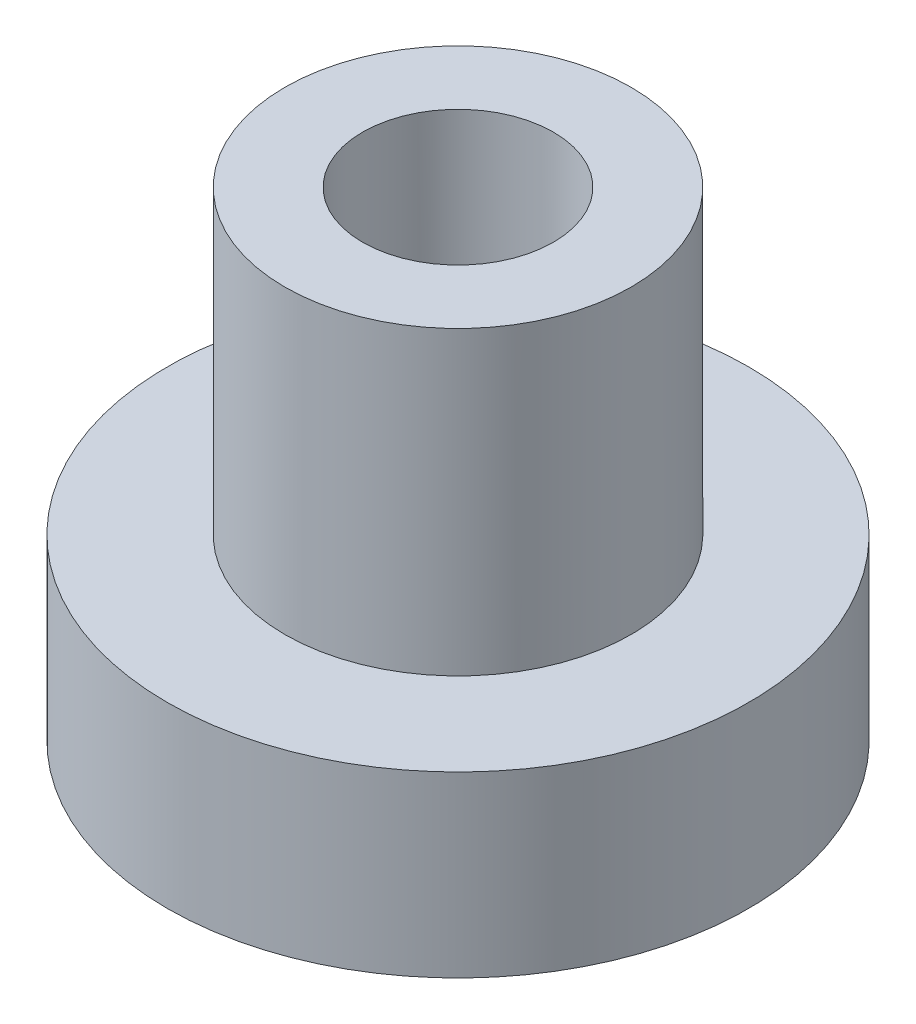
ISO-10303-21;
HEADER;
FILE_DESCRIPTION(('STEP AP214'),'2;1');
FILE_NAME('part.step','',(''),(''),'','','');
FILE_SCHEMA(('AUTOMOTIVE_DESIGN { 1 0 10303 214 1 1 1 1 }'));
ENDSEC;
DATA;
#1=APPLICATION_CONTEXT('core data for automotive mechanical design processes');
#2=APPLICATION_PROTOCOL_DEFINITION('international standard','automotive_design',2000,#1);
#3=PRODUCT_CONTEXT('',#1,'mechanical');
#4=PRODUCT('Part','Part','',(#3));
#5=PRODUCT_RELATED_PRODUCT_CATEGORY('part','',(#4));
#6=PRODUCT_DEFINITION_FORMATION('','',#4);
#7=PRODUCT_DEFINITION_CONTEXT('part definition',#1,'design');
#8=PRODUCT_DEFINITION('design','',#6,#7);
#9=PRODUCT_DEFINITION_SHAPE('','',#8);
#10=(LENGTH_UNIT() NAMED_UNIT(*) SI_UNIT(.MILLI.,.METRE.));
#11=(NAMED_UNIT(*) PLANE_ANGLE_UNIT() SI_UNIT($,.RADIAN.));
#12=(NAMED_UNIT(*) SI_UNIT($,.STERADIAN.) SOLID_ANGLE_UNIT());
#13=UNCERTAINTY_MEASURE_WITH_UNIT(LENGTH_MEASURE(1.E-05),#10,'distance_accuracy_value','');
#14=(GEOMETRIC_REPRESENTATION_CONTEXT(3) GLOBAL_UNCERTAINTY_ASSIGNED_CONTEXT((#13)) GLOBAL_UNIT_ASSIGNED_CONTEXT((#10,
#11,#12)) REPRESENTATION_CONTEXT('',''));
#15=CARTESIAN_POINT('',(0.,0.,0.));
#16=DIRECTION('',(0.,0.,1.));
#17=DIRECTION('',(1.,0.,0.));
#18=AXIS2_PLACEMENT_3D('',#15,#16,#17);
#19=CARTESIAN_POINT('',(0.,-3.39,0.));
#20=DIRECTION('',(0.,-1.,0.));
#21=DIRECTION('',(0.,0.,-1.));
#22=AXIS2_PLACEMENT_3D('',#19,#20,#21);
#23=CYLINDRICAL_SURFACE('',#22,3.275);
#24=CARTESIAN_POINT('',(0.,-3.39,0.));
#25=DIRECTION('',(0.,1.,0.));
#26=DIRECTION('',(0.,0.,1.));
#27=AXIS2_PLACEMENT_3D('',#24,#25,#26);
#28=CIRCLE('',#27,3.275);
#29=CARTESIAN_POINT('',(0.,-3.39,3.275));
#30=VERTEX_POINT('',#29);
#31=EDGE_CURVE('E10',#30,#30,#28,.T.);
#32=ORIENTED_EDGE('',*,*,#31,.F.);
#33=EDGE_LOOP('',(#32));
#34=FACE_BOUND('',#33,.T.);
#35=CARTESIAN_POINT('',(0.,-5.4,0.));
#36=DIRECTION('',(0.,1.,0.));
#37=DIRECTION('',(0.,0.,1.));
#38=AXIS2_PLACEMENT_3D('',#35,#36,#37);
#39=CIRCLE('',#38,3.275);
#40=CARTESIAN_POINT('',(0.,-5.4,3.275));
#41=VERTEX_POINT('',#40);
#42=EDGE_CURVE('E23',#41,#41,#39,.T.);
#43=ORIENTED_EDGE('',*,*,#42,.T.);
#44=EDGE_LOOP('',(#43));
#45=FACE_BOUND('',#44,.T.);
#46=ADVANCED_FACE('F17',(#34,#45),#23,.T.);
#47=CARTESIAN_POINT('',(0.,-3.39,0.));
#48=DIRECTION('',(0.,1.,0.));
#49=DIRECTION('',(-1.,0.,0.));
#50=AXIS2_PLACEMENT_3D('',#47,#48,#49);
#51=PLANE('',#50);
#52=CARTESIAN_POINT('',(0.,-3.39,0.));
#53=DIRECTION('',(0.,1.,0.));
#54=DIRECTION('',(0.,0.,1.));
#55=AXIS2_PLACEMENT_3D('',#52,#53,#54);
#56=CIRCLE('',#55,1.95);
#57=CARTESIAN_POINT('',(0.,-3.39,1.95));
#58=VERTEX_POINT('',#57);
#59=EDGE_CURVE('E27',#58,#58,#56,.T.);
#60=ORIENTED_EDGE('',*,*,#59,.F.);
#61=EDGE_LOOP('',(#60));
#62=FACE_BOUND('',#61,.T.);
#63=ORIENTED_EDGE('',*,*,#31,.T.);
#64=EDGE_LOOP('',(#63));
#65=FACE_BOUND('',#64,.T.);
#66=ADVANCED_FACE('F74',(#62,#65),#51,.T.);
#67=CARTESIAN_POINT('',(0.,-5.4,0.));
#68=DIRECTION('',(0.,1.,0.));
#69=DIRECTION('',(-1.,0.,0.));
#70=AXIS2_PLACEMENT_3D('',#67,#68,#69);
#71=PLANE('',#70);
#72=CARTESIAN_POINT('',(0.,-5.4,0.));
#73=DIRECTION('',(0.,-1.,0.));
#74=DIRECTION('',(0.,0.,-1.));
#75=AXIS2_PLACEMENT_3D('',#72,#73,#74);
#76=CIRCLE('',#75,1.5);
#77=CARTESIAN_POINT('',(0.,-5.4,-1.5));
#78=VERTEX_POINT('',#77);
#79=EDGE_CURVE('E31',#78,#78,#76,.T.);
#80=ORIENTED_EDGE('',*,*,#79,.F.);
#81=EDGE_LOOP('',(#80));
#82=FACE_BOUND('',#81,.T.);
#83=ORIENTED_EDGE('',*,*,#42,.F.);
#84=EDGE_LOOP('',(#83));
#85=FACE_BOUND('',#84,.T.);
#86=ADVANCED_FACE('F70',(#82,#85),#71,.F.);
#87=CARTESIAN_POINT('',(0.,-3.4,0.));
#88=DIRECTION('',(0.,1.,0.));
#89=DIRECTION('',(0.,0.,1.));
#90=AXIS2_PLACEMENT_3D('',#87,#88,#89);
#91=CYLINDRICAL_SURFACE('',#90,1.075);
#92=CARTESIAN_POINT('',(0.,-3.39,0.));
#93=DIRECTION('',(0.,1.,0.));
#94=DIRECTION('',(0.,0.,1.));
#95=AXIS2_PLACEMENT_3D('',#92,#93,#94);
#96=CIRCLE('',#95,1.075);
#97=CARTESIAN_POINT('',(0.,-3.39,1.075));
#98=VERTEX_POINT('',#97);
#99=EDGE_CURVE('E36',#98,#98,#96,.T.);
#100=ORIENTED_EDGE('',*,*,#99,.F.);
#101=EDGE_LOOP('',(#100));
#102=FACE_BOUND('',#101,.T.);
#103=CARTESIAN_POINT('',(0.,0.,0.));
#104=DIRECTION('',(0.,-1.,0.));
#105=DIRECTION('',(0.,0.,-1.));
#106=AXIS2_PLACEMENT_3D('',#103,#104,#105);
#107=CIRCLE('',#106,1.075);
#108=CARTESIAN_POINT('',(0.,0.,-1.075));
#109=VERTEX_POINT('',#108);
#110=EDGE_CURVE('E39',#109,#109,#107,.T.);
#111=ORIENTED_EDGE('',*,*,#110,.F.);
#112=EDGE_LOOP('',(#111));
#113=FACE_BOUND('',#112,.T.);
#114=ADVANCED_FACE('F73',(#102,#113),#91,.F.);
#115=CARTESIAN_POINT('',(0.,-3.4,0.));
#116=DIRECTION('',(0.,1.,0.));
#117=DIRECTION('',(0.,0.,1.));
#118=AXIS2_PLACEMENT_3D('',#115,#116,#117);
#119=CYLINDRICAL_SURFACE('',#118,1.95);
#120=ORIENTED_EDGE('',*,*,#59,.T.);
#121=EDGE_LOOP('',(#120));
#122=FACE_BOUND('',#121,.T.);
#123=CARTESIAN_POINT('',(0.,0.,0.));
#124=DIRECTION('',(0.,-1.,0.));
#125=DIRECTION('',(0.,0.,-1.));
#126=AXIS2_PLACEMENT_3D('',#123,#124,#125);
#127=CIRCLE('',#126,1.95);
#128=CARTESIAN_POINT('',(0.,0.,-1.95));
#129=VERTEX_POINT('',#128);
#130=EDGE_CURVE('E42',#129,#129,#127,.T.);
#131=ORIENTED_EDGE('',*,*,#130,.T.);
#132=EDGE_LOOP('',(#131));
#133=FACE_BOUND('',#132,.T.);
#134=ADVANCED_FACE('F81',(#122,#133),#119,.T.);
#135=CARTESIAN_POINT('',(0.,0.,0.));
#136=DIRECTION('',(0.,-1.,0.));
#137=DIRECTION('',(1.,0.,0.));
#138=AXIS2_PLACEMENT_3D('',#135,#136,#137);
#139=PLANE('',#138);
#140=ORIENTED_EDGE('',*,*,#110,.T.);
#141=EDGE_LOOP('',(#140));
#142=FACE_BOUND('',#141,.T.);
#143=ORIENTED_EDGE('',*,*,#130,.F.);
#144=EDGE_LOOP('',(#143));
#145=FACE_BOUND('',#144,.T.);
#146=ADVANCED_FACE('F121',(#142,#145),#139,.F.);
#147=CARTESIAN_POINT('',(0.,-3.39,0.));
#148=DIRECTION('',(0.,1.,0.));
#149=DIRECTION('',(0.,0.,1.));
#150=AXIS2_PLACEMENT_3D('',#147,#148,#149);
#151=CIRCLE('',#150,0.25);
#152=CARTESIAN_POINT('',(0.,-3.39,0.25));
#153=VERTEX_POINT('',#152);
#154=EDGE_CURVE('E45',#153,#153,#151,.T.);
#155=ORIENTED_EDGE('',*,*,#154,.F.);
#156=EDGE_LOOP('',(#155));
#157=FACE_BOUND('',#156,.T.);
#158=ORIENTED_EDGE('',*,*,#99,.T.);
#159=EDGE_LOOP('',(#158));
#160=FACE_BOUND('',#159,.T.);
#161=ADVANCED_FACE('F66',(#157,#160),#51,.T.);
#162=CARTESIAN_POINT('',(0.,-5.9,0.));
#163=DIRECTION('',(0.,1.,0.));
#164=DIRECTION('',(0.,0.,1.));
#165=AXIS2_PLACEMENT_3D('',#162,#163,#164);
#166=CYLINDRICAL_SURFACE('',#165,1.5);
#167=CARTESIAN_POINT('',(0.,-5.9,0.));
#168=DIRECTION('',(0.,-1.,0.));
#169=DIRECTION('',(0.,0.,-1.));
#170=AXIS2_PLACEMENT_3D('',#167,#168,#169);
#171=CIRCLE('',#170,1.5);
#172=CARTESIAN_POINT('',(0.,-5.9,-1.5));
#173=VERTEX_POINT('',#172);
#174=EDGE_CURVE('E48',#173,#173,#171,.T.);
#175=ORIENTED_EDGE('',*,*,#174,.F.);
#176=EDGE_LOOP('',(#175));
#177=FACE_BOUND('',#176,.T.);
#178=ORIENTED_EDGE('',*,*,#79,.T.);
#179=EDGE_LOOP('',(#178));
#180=FACE_BOUND('',#179,.T.);
#181=ADVANCED_FACE('F60',(#177,#180),#166,.T.);
#182=CARTESIAN_POINT('',(0.,-5.9,0.));
#183=DIRECTION('',(0.,-1.,0.));
#184=DIRECTION('',(1.,0.,0.));
#185=AXIS2_PLACEMENT_3D('',#182,#183,#184);
#186=PLANE('',#185);
#187=CARTESIAN_POINT('',(0.,-5.9,0.));
#188=DIRECTION('',(0.,-1.,0.));
#189=DIRECTION('',(0.,0.,-1.));
#190=AXIS2_PLACEMENT_3D('',#187,#188,#189);
#191=CIRCLE('',#190,0.25);
#192=CARTESIAN_POINT('',(0.,-5.9,-0.25));
#193=VERTEX_POINT('',#192);
#194=EDGE_CURVE('E51',#193,#193,#191,.T.);
#195=ORIENTED_EDGE('',*,*,#194,.F.);
#196=EDGE_LOOP('',(#195));
#197=FACE_BOUND('',#196,.T.);
#198=ORIENTED_EDGE('',*,*,#174,.T.);
#199=EDGE_LOOP('',(#198));
#200=FACE_BOUND('',#199,.T.);
#201=ADVANCED_FACE('F57',(#197,#200),#186,.T.);
#202=CARTESIAN_POINT('',(0.,19.1,0.));
#203=DIRECTION('',(0.,-1.,0.));
#204=DIRECTION('',(0.,0.,-1.));
#205=AXIS2_PLACEMENT_3D('',#202,#203,#204);
#206=CYLINDRICAL_SURFACE('',#205,0.25);
#207=ORIENTED_EDGE('',*,*,#154,.T.);
#208=EDGE_LOOP('',(#207));
#209=FACE_BOUND('',#208,.T.);
#210=ORIENTED_EDGE('',*,*,#194,.T.);
#211=EDGE_LOOP('',(#210));
#212=FACE_BOUND('',#211,.T.);
#213=ADVANCED_FACE('F55',(#209,#212),#206,.F.);
#214=CLOSED_SHELL('',(#46,#66,#86,#114,#134,#146,#161,#181,#201,#213));
#215=MANIFOLD_SOLID_BREP('B1',#214);
#216=ADVANCED_BREP_SHAPE_REPRESENTATION('',(#18,#215),#14);
#217=SHAPE_DEFINITION_REPRESENTATION(#9,#216);
ENDSEC;
END-ISO-10303-21;
